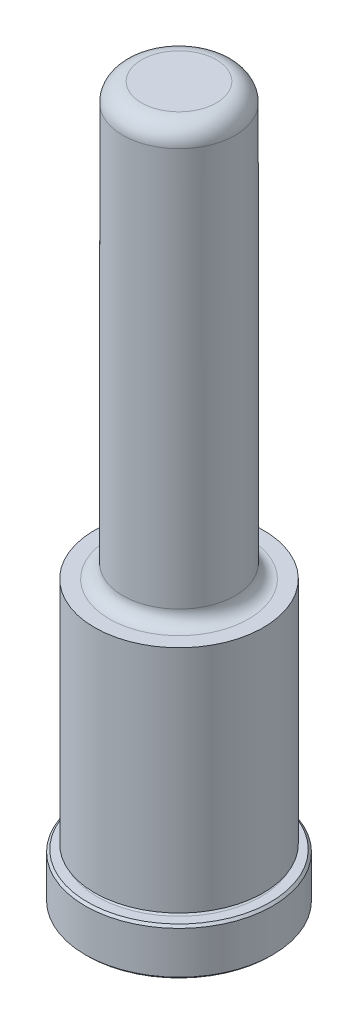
ISO-10303-21;
HEADER;
FILE_DESCRIPTION(('STEP AP214'),'2;1');
FILE_NAME('part.step','',(''),(''),'','','');
FILE_SCHEMA(('AUTOMOTIVE_DESIGN { 1 0 10303 214 1 1 1 1 }'));
ENDSEC;
DATA;
#1=APPLICATION_CONTEXT('core data for automotive mechanical design processes');
#2=APPLICATION_PROTOCOL_DEFINITION('international standard','automotive_design',2000,#1);
#3=PRODUCT_CONTEXT('',#1,'mechanical');
#4=PRODUCT('Part','Part','',(#3));
#5=PRODUCT_RELATED_PRODUCT_CATEGORY('part','',(#4));
#6=PRODUCT_DEFINITION_FORMATION('','',#4);
#7=PRODUCT_DEFINITION_CONTEXT('part definition',#1,'design');
#8=PRODUCT_DEFINITION('design','',#6,#7);
#9=PRODUCT_DEFINITION_SHAPE('','',#8);
#10=(LENGTH_UNIT() NAMED_UNIT(*) SI_UNIT(.MILLI.,.METRE.));
#11=(NAMED_UNIT(*) PLANE_ANGLE_UNIT() SI_UNIT($,.RADIAN.));
#12=(NAMED_UNIT(*) SI_UNIT($,.STERADIAN.) SOLID_ANGLE_UNIT());
#13=UNCERTAINTY_MEASURE_WITH_UNIT(LENGTH_MEASURE(1.E-05),#10,'distance_accuracy_value','');
#14=(GEOMETRIC_REPRESENTATION_CONTEXT(3) GLOBAL_UNCERTAINTY_ASSIGNED_CONTEXT((#13)) GLOBAL_UNIT_ASSIGNED_CONTEXT((#10,
#11,#12)) REPRESENTATION_CONTEXT('',''));
#15=CARTESIAN_POINT('',(0.,0.,0.));
#16=DIRECTION('',(0.,0.,1.));
#17=DIRECTION('',(1.,0.,0.));
#18=AXIS2_PLACEMENT_3D('',#15,#16,#17);
#19=CARTESIAN_POINT('',(0.,0.,0.));
#20=DIRECTION('',(0.,1.,0.));
#21=DIRECTION('',(0.,0.,1.));
#22=AXIS2_PLACEMENT_3D('',#19,#20,#21);
#23=PLANE('',#22);
#24=CARTESIAN_POINT('',(0.,0.,0.));
#25=DIRECTION('',(0.,1.,0.));
#26=DIRECTION('',(0.,0.,1.));
#27=AXIS2_PLACEMENT_3D('',#24,#25,#26);
#28=CIRCLE('',#27,15.494);
#29=CARTESIAN_POINT('',(0.,0.,15.494));
#30=VERTEX_POINT('',#29);
#31=EDGE_CURVE('E46',#30,#30,#28,.F.);
#32=ORIENTED_EDGE('',*,*,#31,.T.);
#33=EDGE_LOOP('',(#32));
#34=FACE_BOUND('',#33,.T.);
#35=ADVANCED_FACE('F31',(#34),#23,.F.);
#36=CARTESIAN_POINT('',(0.,0.,0.));
#37=DIRECTION('',(0.,1.,0.));
#38=DIRECTION('',(0.,0.,1.));
#39=AXIS2_PLACEMENT_3D('',#36,#37,#38);
#40=CYLINDRICAL_SURFACE('',#39,15.875);
#41=CARTESIAN_POINT('',(0.,0.381000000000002,0.));
#42=DIRECTION('',(0.,1.,0.));
#43=DIRECTION('',(0.,0.,1.));
#44=AXIS2_PLACEMENT_3D('',#41,#42,#43);
#45=CIRCLE('',#44,15.875);
#46=CARTESIAN_POINT('',(0.,0.381,15.875));
#47=VERTEX_POINT('',#46);
#48=EDGE_CURVE('E51',#47,#47,#45,.T.);
#49=ORIENTED_EDGE('',*,*,#48,.T.);
#50=EDGE_LOOP('',(#49));
#51=FACE_BOUND('',#50,.T.);
#52=CARTESIAN_POINT('',(0.,7.54379999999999,0.));
#53=DIRECTION('',(0.,-1.,0.));
#54=DIRECTION('',(0.,0.,-1.));
#55=AXIS2_PLACEMENT_3D('',#52,#53,#54);
#56=CIRCLE('',#55,15.875);
#57=CARTESIAN_POINT('',(0.,7.54379999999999,-15.875));
#58=VERTEX_POINT('',#57);
#59=EDGE_CURVE('E54',#58,#58,#56,.T.);
#60=ORIENTED_EDGE('',*,*,#59,.T.);
#61=EDGE_LOOP('',(#60));
#62=FACE_BOUND('',#61,.T.);
#63=ADVANCED_FACE('F110',(#51,#62),#40,.T.);
#64=CARTESIAN_POINT('',(0.,7.9248,-15.875));
#65=DIRECTION('',(0.,-1.,0.));
#66=DIRECTION('',(0.,0.,-1.));
#67=AXIS2_PLACEMENT_3D('',#64,#65,#66);
#68=PLANE('',#67);
#69=CARTESIAN_POINT('',(0.,7.9248,0.));
#70=DIRECTION('',(0.,-1.,0.));
#71=DIRECTION('',(0.,0.,-1.));
#72=AXIS2_PLACEMENT_3D('',#69,#70,#71);
#73=CIRCLE('',#72,15.494);
#74=CARTESIAN_POINT('',(0.,7.9248,-15.494));
#75=VERTEX_POINT('',#74);
#76=EDGE_CURVE('E42',#75,#75,#73,.F.);
#77=ORIENTED_EDGE('',*,*,#76,.T.);
#78=EDGE_LOOP('',(#77));
#79=FACE_BOUND('',#78,.T.);
#80=CARTESIAN_POINT('',(0.,7.9248,0.));
#81=DIRECTION('',(0.,1.,0.));
#82=DIRECTION('',(0.,0.,1.));
#83=AXIS2_PLACEMENT_3D('',#80,#81,#82);
#84=CIRCLE('',#83,13.8938);
#85=CARTESIAN_POINT('',(0.,7.9248,13.8938));
#86=VERTEX_POINT('',#85);
#87=EDGE_CURVE('E57',#86,#86,#84,.T.);
#88=ORIENTED_EDGE('',*,*,#87,.F.);
#89=EDGE_LOOP('',(#88));
#90=FACE_BOUND('',#89,.T.);
#91=ADVANCED_FACE('F105',(#79,#90),#68,.F.);
#92=CARTESIAN_POINT('',(0.,8.3058,0.));
#93=DIRECTION('',(0.,1.,0.));
#94=DIRECTION('',(0.,0.,1.));
#95=AXIS2_PLACEMENT_3D('',#92,#93,#94);
#96=TOROIDAL_SURFACE('',#95,13.8938,0.381000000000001);
#97=CARTESIAN_POINT('',(0.,8.68680000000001,0.));
#98=DIRECTION('',(0.,1.,0.));
#99=DIRECTION('',(0.,0.,1.));
#100=AXIS2_PLACEMENT_3D('',#97,#98,#99);
#101=CIRCLE('',#100,13.8938);
#102=CARTESIAN_POINT('',(0.,8.6868,13.8938));
#103=VERTEX_POINT('',#102);
#104=EDGE_CURVE('E60',#103,#103,#101,.T.);
#105=ORIENTED_EDGE('',*,*,#104,.F.);
#106=EDGE_LOOP('',(#105));
#107=FACE_BOUND('',#106,.T.);
#108=ORIENTED_EDGE('',*,*,#87,.T.);
#109=EDGE_LOOP('',(#108));
#110=FACE_BOUND('',#109,.T.);
#111=ADVANCED_FACE('F99',(#107,#110),#96,.F.);
#112=CARTESIAN_POINT('',(0.,8.68680000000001,-13.8938));
#113=DIRECTION('',(0.,1.,0.));
#114=DIRECTION('',(0.,0.,1.));
#115=AXIS2_PLACEMENT_3D('',#112,#113,#114);
#116=PLANE('',#115);
#117=CARTESIAN_POINT('',(0.,8.6868,0.));
#118=DIRECTION('',(0.,1.,0.));
#119=DIRECTION('',(0.,0.,1.));
#120=AXIS2_PLACEMENT_3D('',#117,#118,#119);
#121=CIRCLE('',#120,14.3002);
#122=CARTESIAN_POINT('',(0.,8.6868,14.3002));
#123=VERTEX_POINT('',#122);
#124=EDGE_CURVE('E63',#123,#123,#121,.T.);
#125=ORIENTED_EDGE('',*,*,#124,.F.);
#126=EDGE_LOOP('',(#125));
#127=FACE_BOUND('',#126,.T.);
#128=ORIENTED_EDGE('',*,*,#104,.T.);
#129=EDGE_LOOP('',(#128));
#130=FACE_BOUND('',#129,.T.);
#131=ADVANCED_FACE('F93',(#127,#130),#116,.F.);
#132=CARTESIAN_POINT('',(0.,0.,0.));
#133=DIRECTION('',(0.,1.,0.));
#134=DIRECTION('',(0.,0.,1.));
#135=AXIS2_PLACEMENT_3D('',#132,#133,#134);
#136=CYLINDRICAL_SURFACE('',#135,14.3002);
#137=CARTESIAN_POINT('',(0.,47.625,0.));
#138=DIRECTION('',(0.,1.,0.));
#139=DIRECTION('',(0.,0.,1.));
#140=AXIS2_PLACEMENT_3D('',#137,#138,#139);
#141=CIRCLE('',#140,14.3002);
#142=CARTESIAN_POINT('',(0.,47.625,14.3002));
#143=VERTEX_POINT('',#142);
#144=EDGE_CURVE('E66',#143,#143,#141,.T.);
#145=ORIENTED_EDGE('',*,*,#144,.F.);
#146=EDGE_LOOP('',(#145));
#147=FACE_BOUND('',#146,.T.);
#148=ORIENTED_EDGE('',*,*,#124,.T.);
#149=EDGE_LOOP('',(#148));
#150=FACE_BOUND('',#149,.T.);
#151=ADVANCED_FACE('F87',(#147,#150),#136,.T.);
#152=CARTESIAN_POINT('',(0.,47.625,-14.3002));
#153=DIRECTION('',(0.,-1.,0.));
#154=DIRECTION('',(0.,0.,-1.));
#155=AXIS2_PLACEMENT_3D('',#152,#153,#154);
#156=PLANE('',#155);
#157=CARTESIAN_POINT('',(0.,47.625,0.));
#158=DIRECTION('',(0.,1.,0.));
#159=DIRECTION('',(0.,0.,1.));
#160=AXIS2_PLACEMENT_3D('',#157,#158,#159);
#161=CIRCLE('',#160,11.7983);
#162=CARTESIAN_POINT('',(0.,47.625,11.7983));
#163=VERTEX_POINT('',#162);
#164=EDGE_CURVE('E69',#163,#163,#161,.T.);
#165=ORIENTED_EDGE('',*,*,#164,.F.);
#166=EDGE_LOOP('',(#165));
#167=FACE_BOUND('',#166,.T.);
#168=ORIENTED_EDGE('',*,*,#144,.T.);
#169=EDGE_LOOP('',(#168));
#170=FACE_BOUND('',#169,.T.);
#171=ADVANCED_FACE('F81',(#167,#170),#156,.F.);
#172=CARTESIAN_POINT('',(0.,49.911,0.));
#173=DIRECTION('',(0.,1.,0.));
#174=DIRECTION('',(0.,0.,1.));
#175=AXIS2_PLACEMENT_3D('',#172,#173,#174);
#176=TOROIDAL_SURFACE('',#175,11.7983,2.286);
#177=CARTESIAN_POINT('',(0.,49.911,0.));
#178=DIRECTION('',(0.,1.,0.));
#179=DIRECTION('',(0.,0.,1.));
#180=AXIS2_PLACEMENT_3D('',#177,#178,#179);
#181=CIRCLE('',#180,9.5123);
#182=CARTESIAN_POINT('',(0.,49.911,9.5123));
#183=VERTEX_POINT('',#182);
#184=EDGE_CURVE('E72',#183,#183,#181,.T.);
#185=ORIENTED_EDGE('',*,*,#184,.F.);
#186=EDGE_LOOP('',(#185));
#187=FACE_BOUND('',#186,.T.);
#188=ORIENTED_EDGE('',*,*,#164,.T.);
#189=EDGE_LOOP('',(#188));
#190=FACE_BOUND('',#189,.T.);
#191=ADVANCED_FACE('F78',(#187,#190),#176,.F.);
#192=CARTESIAN_POINT('',(0.,0.,0.));
#193=DIRECTION('',(0.,1.,0.));
#194=DIRECTION('',(0.,0.,1.));
#195=AXIS2_PLACEMENT_3D('',#192,#193,#194);
#196=CYLINDRICAL_SURFACE('',#195,9.5123);
#197=CARTESIAN_POINT('',(0.,117.475,0.));
#198=DIRECTION('',(0.,-1.,0.));
#199=DIRECTION('',(0.,0.,-1.));
#200=AXIS2_PLACEMENT_3D('',#197,#198,#199);
#201=CIRCLE('',#200,9.5123);
#202=CARTESIAN_POINT('',(0.,117.475,-9.51229999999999));
#203=VERTEX_POINT('',#202);
#204=EDGE_CURVE('E10',#203,#203,#201,.T.);
#205=ORIENTED_EDGE('',*,*,#204,.T.);
#206=EDGE_LOOP('',(#205));
#207=FACE_BOUND('',#206,.T.);
#208=ORIENTED_EDGE('',*,*,#184,.T.);
#209=EDGE_LOOP('',(#208));
#210=FACE_BOUND('',#209,.T.);
#211=ADVANCED_FACE('F76',(#207,#210),#196,.T.);
#212=CARTESIAN_POINT('',(0.,120.65,-9.51229999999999));
#213=DIRECTION('',(0.,-1.,0.));
#214=DIRECTION('',(0.,0.,-1.));
#215=AXIS2_PLACEMENT_3D('',#212,#213,#214);
#216=PLANE('',#215);
#217=CARTESIAN_POINT('',(0.,120.65,0.));
#218=DIRECTION('',(0.,-1.,0.));
#219=DIRECTION('',(0.,0.,-1.));
#220=AXIS2_PLACEMENT_3D('',#217,#218,#219);
#221=CIRCLE('',#220,6.3373);
#222=CARTESIAN_POINT('',(0.,120.65,-6.33729999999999));
#223=VERTEX_POINT('',#222);
#224=EDGE_CURVE('E38',#223,#223,#221,.F.);
#225=ORIENTED_EDGE('',*,*,#224,.T.);
#226=EDGE_LOOP('',(#225));
#227=FACE_BOUND('',#226,.T.);
#228=ADVANCED_FACE('F127',(#227),#216,.F.);
#229=CARTESIAN_POINT('',(0.,0.381000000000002,0.));
#230=DIRECTION('',(0.,1.,0.));
#231=DIRECTION('',(0.,0.,1.));
#232=AXIS2_PLACEMENT_3D('',#229,#230,#231);
#233=CONICAL_SURFACE('',#232,15.875,0.785398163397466);
#234=ORIENTED_EDGE('',*,*,#31,.F.);
#235=EDGE_LOOP('',(#234));
#236=FACE_BOUND('',#235,.T.);
#237=ORIENTED_EDGE('',*,*,#48,.F.);
#238=EDGE_LOOP('',(#237));
#239=FACE_BOUND('',#238,.T.);
#240=ADVANCED_FACE('F124',(#236,#239),#233,.T.);
#241=CARTESIAN_POINT('',(0.,7.9248,0.));
#242=DIRECTION('',(0.,-1.,0.));
#243=DIRECTION('',(0.,0.,-1.));
#244=AXIS2_PLACEMENT_3D('',#241,#242,#243);
#245=CONICAL_SURFACE('',#244,15.494,0.785398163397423);
#246=ORIENTED_EDGE('',*,*,#59,.F.);
#247=EDGE_LOOP('',(#246));
#248=FACE_BOUND('',#247,.T.);
#249=ORIENTED_EDGE('',*,*,#76,.F.);
#250=EDGE_LOOP('',(#249));
#251=FACE_BOUND('',#250,.T.);
#252=ADVANCED_FACE('F126',(#248,#251),#245,.T.);
#253=CARTESIAN_POINT('',(0.,117.475,0.));
#254=DIRECTION('',(0.,-1.,0.));
#255=DIRECTION('',(0.,0.,-1.));
#256=AXIS2_PLACEMENT_3D('',#253,#254,#255);
#257=TOROIDAL_SURFACE('',#256,6.3373,3.175);
#258=ORIENTED_EDGE('',*,*,#204,.F.);
#259=EDGE_LOOP('',(#258));
#260=FACE_BOUND('',#259,.T.);
#261=ORIENTED_EDGE('',*,*,#224,.F.);
#262=EDGE_LOOP('',(#261));
#263=FACE_BOUND('',#262,.T.);
#264=ADVANCED_FACE('F33',(#260,#263),#257,.T.);
#265=CLOSED_SHELL('',(#35,#63,#91,#111,#131,#151,#171,#191,#211,#228,#240,#252,#264));
#266=MANIFOLD_SOLID_BREP('B2',#265);
#267=ADVANCED_BREP_SHAPE_REPRESENTATION('',(#18,#266),#14);
#268=SHAPE_DEFINITION_REPRESENTATION(#9,#267);
ENDSEC;
END-ISO-10303-21;
